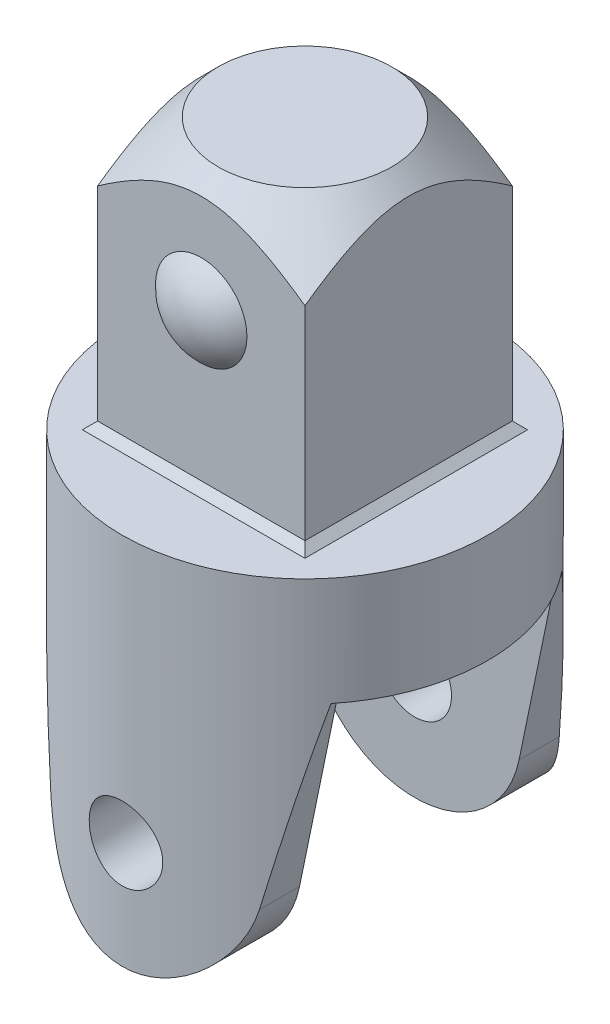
from build123d import *

# Parameters (mm, degrees)
SKETCH1_R           = 12
BOSS_EXTRUDE1_DEPTH = 33.53
CUT_EXTRUDE1_DEPTH  = 19.6
CHAMFER1_SIZE       = 0.4
SKETCH3_R           = 9.375
CUT_EXTRUDE2_DEPTH  = 3.4
CUT_EXTRUDE2_DRAFT  = -35
SKETCH4_W           = 24
SKETCH4_H           = 14.42225279
CUT_EXTRUDE3_DEPTH  = 17.4
SKETCH5_R           = 2.415
CUT_EXTRUDE4_DEPTH  = 33.7
CUT_EXTRUDE5_START  = -9
SKETCH6_R           = 12
CUT_EXTRUDE5_DEPTH  = 9
BOSS_EXTRUDE2_START = -7.13
SKETCH7_R           = 12
BOSS_EXTRUDE2_DEPTH = 7.13
SKETCH8_W           = 13.62
SKETCH8_H           = 13.62
BOSS_EXTRUDE3_DEPTH = 17.8
CHAMFER2_SIZE       = 0.5


with BuildPart() as part:
    # Sketch1 → Boss-Extrude1 (new body)
    with BuildSketch(Plane(origin=(0, 0, 0), x_dir=(1, 0, 0), z_dir=(0, 1, 0))):
        with Locations(Location((0, 0, 0), (0, 0, 270))):
            Circle(SKETCH1_R)
    extrude(amount=BOSS_EXTRUDE1_DEPTH)

    # Sketch2 → Cut-Extrude1 (cut)
    with BuildSketch(Plane(origin=(0, 33.53, 0), x_dir=(1, 0, 0), z_dir=(0, 1, 0))):
        with BuildLine():
            Line((-6.5, 6.5), (-2.5, 6.5))
            ThreePointArc((-2.5, 6.5), (0, 7.211126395), (2.5, 6.5))
            Line((2.5, 6.5), (6.5, 6.5))
            Line((6.5, 6.5), (6.5, 2.5))
            ThreePointArc((6.5, 2.5), (7.211126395, 0), (6.5, -2.5))
            Line((6.5, -2.5), (6.5, -6.5))
            Line((6.5, -6.5), (2.5, -6.5))
            ThreePointArc((2.5, -6.5), (0, -7.211126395), (-2.5, -6.5))
            Line((-2.5, -6.5), (-6.5, -6.5))
            Line((-6.5, -6.5), (-6.5, -2.5))
            ThreePointArc((-6.5, -2.5), (-7.211126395, 0), (-6.5, 2.5))
            Line((-6.5, 2.5), (-6.5, 6.5))
        make_face()
    extrude(amount=-CUT_EXTRUDE1_DEPTH, mode=Mode.SUBTRACT)

    # Chamfer1
    chamfer1_edges = [part.edges().sort_by_distance(p)[0] for p in [
        (-6.5, 23.73, -6.5),
        (6.5, 23.73, -6.5),
        (6.5, 23.73, 6.5),
        (-6.5, 23.73, 6.5),
    ]]
    chamfer(chamfer1_edges, length=CHAMFER1_SIZE)


with BuildPart() as cut_extrude2_tool:
    # Sketch3 → Cut-Extrude2 (with draft: the straight prism first)
    with BuildSketch(Plane(origin=(0, 33.53, 0), x_dir=(1, 0, 0), z_dir=(0, 1, 0))):
        Circle(SKETCH3_R)
    extrude(amount=-CUT_EXTRUDE2_DEPTH)
    # Cut-Extrude2: the draft: its side faces are tilted about the plane it starts from
    cut_extrude2_sides = [cut_extrude2_tool.faces().sort_by_distance(p)[0] for p in [
        (-9.375, 31.83, 0),
    ]]
    draft(cut_extrude2_sides, Plane(origin=(0, 33.53, 0), x_dir=(1, 0, 0), z_dir=(0, 1, 0)), CUT_EXTRUDE2_DRAFT)


with BuildPart() as part_1:
    add(part.part)

    # Cut-Extrude2: cut by cut_extrude2_tool
    add(cut_extrude2_tool.part, mode=Mode.SUBTRACT)

    # Sketch4 → Cut-Extrude3 (cut)
    with BuildSketch(Plane.XZ):
        Rectangle(SKETCH4_W, SKETCH4_H)
    extrude(amount=-CUT_EXTRUDE3_DEPTH, mode=Mode.SUBTRACT)

    # Sketch5 → Cut-Extrude4 (cut, symmetric)
    with BuildSketch(Plane.XY):
        with Locations(Location((0, 7, 0), (0, 0, 90))):
            Circle(SKETCH5_R)
        with BuildLine():
            ThreePointArc((-6.854820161, 5.581747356), (0, 0), (6.854820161, 5.581747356))
            Line((6.854820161, 5.581747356), (9.3, 17.4))
            Line((9.3, 17.4), (12, 17.4))
            Line((12, 17.4), (12, -3.192277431))
            Line((12, -3.192277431), (-12, -3.192277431))
            Line((-12, -3.192277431), (-12, 17.4))
            Line((-12, 17.4), (-9.3, 17.4))
            Line((-9.3, 17.4), (-6.854820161, 5.581747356))
        make_face()
    extrude(amount=CUT_EXTRUDE4_DEPTH, both=True, mode=Mode.SUBTRACT)

    # Sketch6 → Cut-Extrude5 (cut)
    with BuildSketch(Plane(origin=(0, 33.53, 0), x_dir=(1, 0, 0), z_dir=(0, 1, 0)).offset(CUT_EXTRUDE5_START)):
        with Locations(Location((0, 0, 0), (0, 0, 55.16360803))):
            Circle(SKETCH6_R)
    extrude(amount=CUT_EXTRUDE5_DEPTH, mode=Mode.SUBTRACT)

    # Sketch7 → Boss-Extrude2 (add)
    with BuildSketch(Plane(origin=(0, 24.53, 0), x_dir=(1, 0, 0), z_dir=(0, 1, 0)).offset(BOSS_EXTRUDE2_START)):
        with Locations(Location((0, 0, 0), (0, 0, 55.16360803))):
            Circle(SKETCH7_R)
    extrude(amount=BOSS_EXTRUDE2_DEPTH)

    # Sketch8 → Boss-Extrude3 (add)
    with BuildSketch(Plane(origin=(0, 24.53, 0), x_dir=(1, 0, 0), z_dir=(0, 1, 0))):
        Rectangle(SKETCH8_W, SKETCH8_H)
    extrude(amount=BOSS_EXTRUDE3_DEPTH)

    # Sketch9 → Cut-Revolve1 (revolve, cut)
    with BuildSketch(Plane.XY, mode=Mode.PRIVATE) as cut_revolve1_sk:
        Polygon((5.7, 42.33), (13.111265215, 42.33), (13.111265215, 34.918734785), align=None)
    revolve(cut_revolve1_sk.sketch.rotate(Axis((0, 44.4465, 0), (0, -1, 0)), 304.83639197), axis=Axis((0, 44.4465, 0), (0, -1, 0)), mode=Mode.SUBTRACT)

    # Chamfer2
    chamfer2_edges = [part_1.edges().sort_by_distance(p)[0] for p in [
        (6.81, 24.53, 0),
        (0, 24.53, -6.81),
        (-6.81, 24.53, 0),
        (0, 24.53, 6.81),
    ]]
    chamfer(chamfer2_edges, length=CHAMFER2_SIZE)

    # Sketch10 → Revolve1 (revolve)
    with BuildSketch(Plane(origin=(0, 0, 0), x_dir=(0, 0, -1), z_dir=(1, 0, 0))):
        with BuildLine():
            Line((6.81, 34.73), (6.81, 31.73))
            ThreePointArc((6.81, 31.73), (7.806952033, 33.085121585), (8.16, 34.73))
            Line((8.16, 34.73), (6.81, 34.73))
        make_face()
    revolve1 = revolve(axis=Axis((0, 34.73, -6.81), (0, 0, -1)))

    # Mirror1: Revolve1 across plane
    add(revolve1.mirror(Plane.XY))


solid = part_1.part
